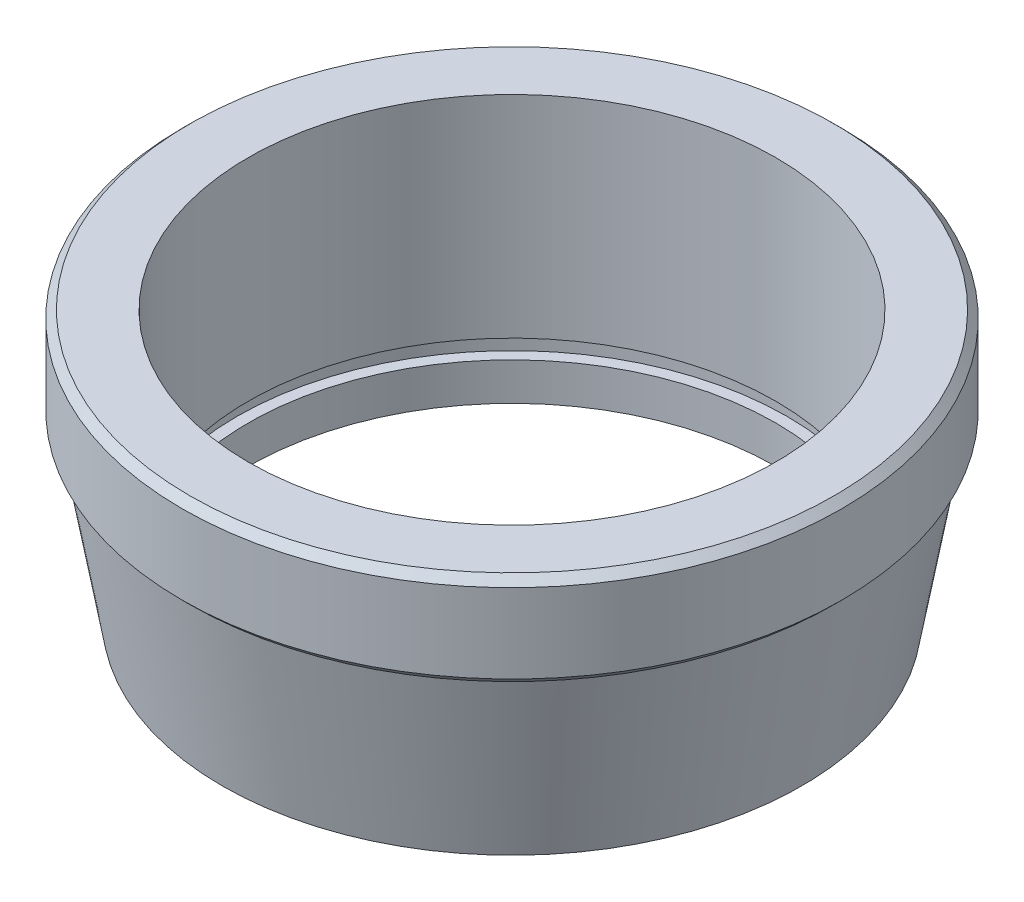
from build123d import *

# Parameters (mm, degrees)
SKICA1_R                 = 8.5
P_IDAT_VYSUNUT_M1_DEPTH  = 4.6
P_IDAT_VYSUNUT_M1_DRAFT  = -10
SKICA2_R                 = 8.75
P_IDAT_VYSUNUT_M2_DEPTH  = 2.5
ZKOSEN_1_SIZE            = 0.2
SKICA3_R                 = 7
ODEBRAT_VYSUNUT_M1_DEPTH = 2.5
ODEBRAT_START            = -4.6
SKICA4_R                 = 7
ODEBRAT_VYSUNUT_M2_DEPTH = 4.6
SKICA5_W                 = 0.3
SKICA5_H                 = 0.5


with BuildPart() as part:
    # Skica1 → P_idat vysunut_m1 (with draft: the straight prism first)
    with BuildSketch(Plane(origin=(0, 0, 0), x_dir=(1, 0, 0), z_dir=(0, 1, 0))):
        Circle(SKICA1_R)
    extrude(amount=-P_IDAT_VYSUNUT_M1_DEPTH)
    # P_idat vysunut_m1: the draft: its side faces are tilted about the plane it starts from
    p_idat_vysunut_m1_sides = [part.faces().sort_by_distance(p)[0] for p in [
        (-8.5, -2.3, 0),
    ]]
    draft(p_idat_vysunut_m1_sides, Plane(origin=(0, 0, 0), x_dir=(1, 0, 0), z_dir=(0, 1, 0)), P_IDAT_VYSUNUT_M1_DRAFT)

    # Skica2 → P_idat vysunut_m2 (add)
    with BuildSketch(Plane(origin=(0, 0, 0), x_dir=(-1, 0, 0), z_dir=(0, 1, 0))):
        with Locations(Location((0, 0, 0), (0, 0, 90))):
            Circle(SKICA2_R)
    extrude(amount=P_IDAT_VYSUNUT_M2_DEPTH)

    # Zkosen_1
    zkosen_1_edges = [part.edges().sort_by_distance(p)[0] for p in [
        (0, 0, -8.75),
        (0, 2.5, -8.75),
    ]]
    chamfer(zkosen_1_edges, length=ZKOSEN_1_SIZE)

    # Skica3 → Odebrat vysunut_m1 (cut)
    with BuildSketch(Plane(origin=(0, 2.5, 0), x_dir=(1, 0, 0), z_dir=(0, 1, 0))):
        with Locations(Location((0, 0, 0), (0, 0, 270))):
            Circle(SKICA3_R)
    extrude(amount=-ODEBRAT_VYSUNUT_M1_DEPTH, mode=Mode.SUBTRACT)

    # Skica4 → Odebrat vysunut_m2 (cut)
    with BuildSketch(Plane.XZ.offset(4.6).offset(ODEBRAT_START)):
        with Locations(Location((0, 0, 0), (0, 0, 90))):
            Circle(SKICA4_R)
    extrude(amount=ODEBRAT_VYSUNUT_M2_DEPTH, mode=Mode.SUBTRACT)

    # Skica5 → Odebrat rotac_1 (revolve, cut)
    with BuildSketch(Plane.XY, mode=Mode.PRIVATE) as odebrat_rotac_1_sk:
        with Locations((-7.15, -3.35)):
            Rectangle(SKICA5_W, SKICA5_H)
    revolve(odebrat_rotac_1_sk.sketch.rotate(Axis((0, 2.5, 0), (0, -1, 0)), 270), axis=Axis((0, 2.5, 0), (0, -1, 0)), mode=Mode.SUBTRACT)


solid = part.part
